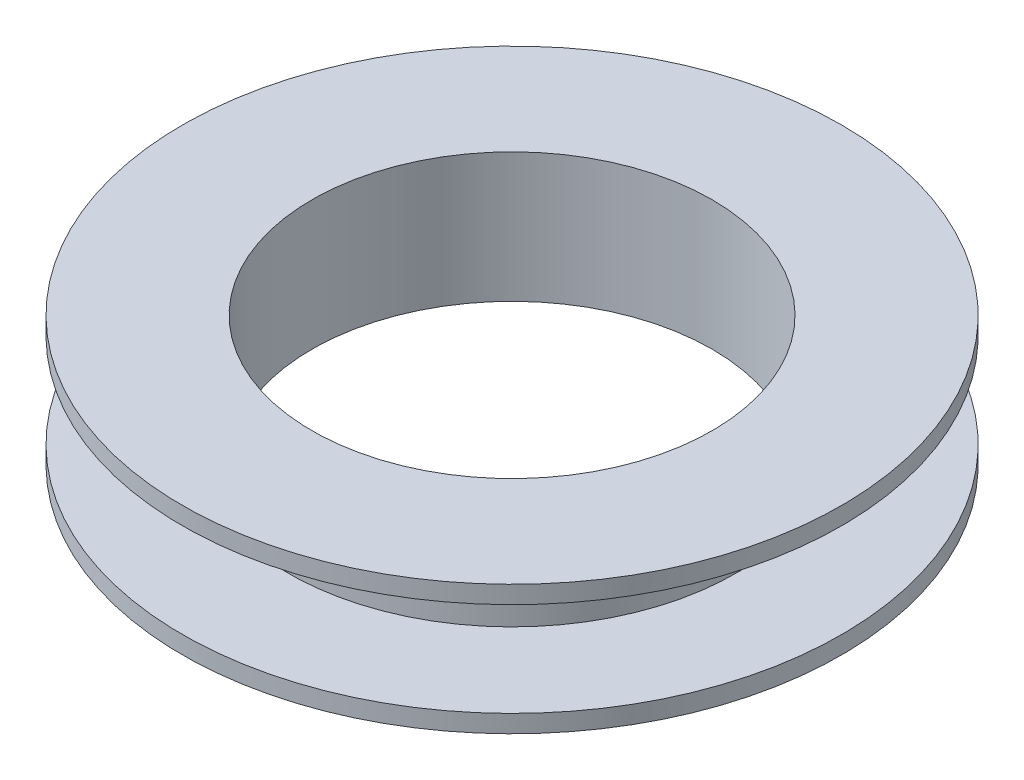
from build123d import *


with BuildPart() as part:
    # Sketch1 → Revolve1 (revolve)
    with BuildSketch(Plane.XY, mode=Mode.PRIVATE) as revolve1_sk:
        Polygon((-177.8, 69.85), (-177.8, 60.325), (-120.65, 60.325), (-120.65, 9.525), (-177.8, 9.525), (-177.8, 0), (-107.95, 0), (-107.95, 69.85), align=None)
    revolve(revolve1_sk.sketch.rotate(Axis((0, 0, 0), (0, 1, 0)), 270), axis=Axis((0, 0, 0), (0, 1, 0)))


solid = part.part
